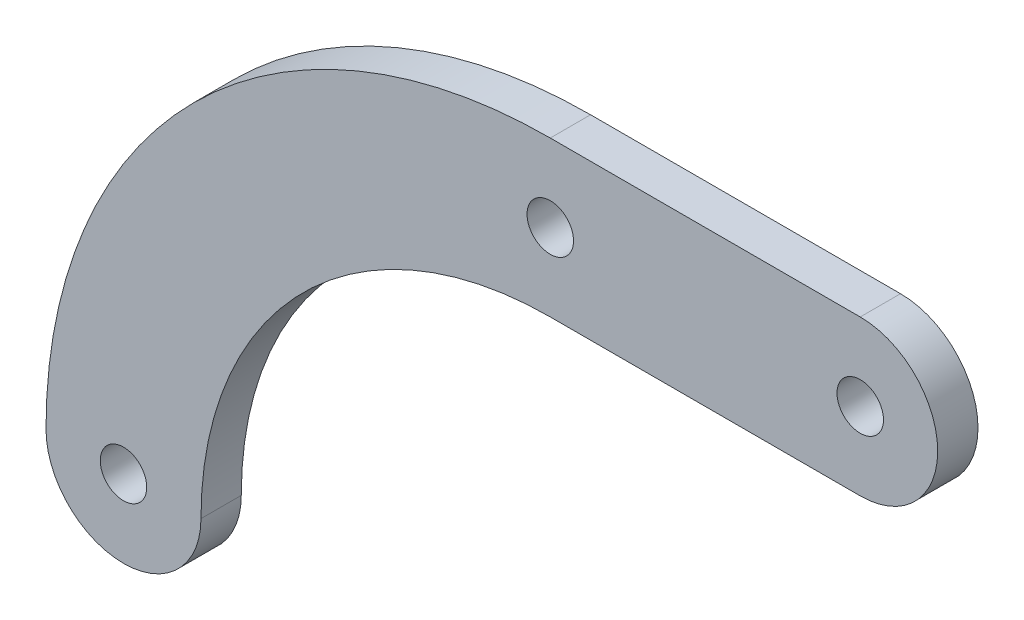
from build123d import *

# Parameters (mm, degrees)
SKETCH1_R           = 1.5
BOSS_EXTRUDE1_DEPTH = 2.6


with BuildPart() as part:
    # Sketch1 → Boss-Extrude1 (new body)
    with BuildSketch(Plane.XY):
        with BuildLine():
            Line((0, 22.54), (20, 22.54))
            ThreePointArc((20, 22.54), (25, 27.54), (20, 32.54))
            Line((20, 32.54), (0, 32.54))
            ThreePointArc((0, 32.54), (-23.00925466, 23.00925466), (-32.54, 0))
            ThreePointArc((-32.54, 0), (-27.54, -5), (-22.54, 0))
            ThreePointArc((-22.54, 0), (-15.938186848, 15.938186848), (0, 22.54))
        make_face()
        with Locations((-27.54, 0)):
            Circle(SKETCH1_R, mode=Mode.SUBTRACT)
        with Locations((0, 27.54)):
            Circle(SKETCH1_R, mode=Mode.SUBTRACT)
        with Locations((20, 27.54)):
            Circle(SKETCH1_R, mode=Mode.SUBTRACT)
    extrude(amount=BOSS_EXTRUDE1_DEPTH)


solid = part.part
